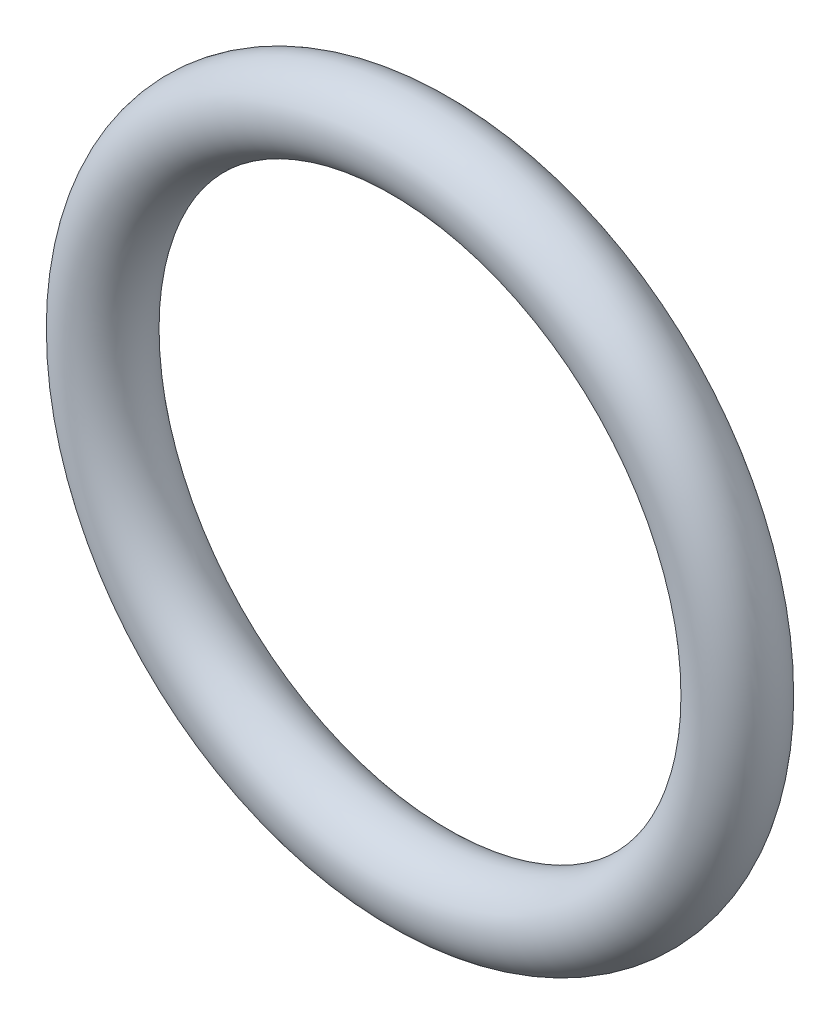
ISO-10303-21;
HEADER;
FILE_DESCRIPTION(('STEP AP214'),'2;1');
FILE_NAME('part.step','',(''),(''),'','','');
FILE_SCHEMA(('AUTOMOTIVE_DESIGN { 1 0 10303 214 1 1 1 1 }'));
ENDSEC;
DATA;
#1=APPLICATION_CONTEXT('core data for automotive mechanical design processes');
#2=APPLICATION_PROTOCOL_DEFINITION('international standard','automotive_design',2000,#1);
#3=PRODUCT_CONTEXT('',#1,'mechanical');
#4=PRODUCT('Part','Part','',(#3));
#5=PRODUCT_RELATED_PRODUCT_CATEGORY('part','',(#4));
#6=PRODUCT_DEFINITION_FORMATION('','',#4);
#7=PRODUCT_DEFINITION_CONTEXT('part definition',#1,'design');
#8=PRODUCT_DEFINITION('design','',#6,#7);
#9=PRODUCT_DEFINITION_SHAPE('','',#8);
#10=(LENGTH_UNIT() NAMED_UNIT(*) SI_UNIT(.MILLI.,.METRE.));
#11=(NAMED_UNIT(*) PLANE_ANGLE_UNIT() SI_UNIT($,.RADIAN.));
#12=(NAMED_UNIT(*) SI_UNIT($,.STERADIAN.) SOLID_ANGLE_UNIT());
#13=UNCERTAINTY_MEASURE_WITH_UNIT(LENGTH_MEASURE(1.E-05),#10,'distance_accuracy_value','');
#14=(GEOMETRIC_REPRESENTATION_CONTEXT(3) GLOBAL_UNCERTAINTY_ASSIGNED_CONTEXT((#13)) GLOBAL_UNIT_ASSIGNED_CONTEXT((#10,
#11,#12)) REPRESENTATION_CONTEXT('',''));
#15=CARTESIAN_POINT('',(0.,0.,0.));
#16=DIRECTION('',(0.,0.,1.));
#17=DIRECTION('',(1.,0.,0.));
#18=AXIS2_PLACEMENT_3D('',#15,#16,#17);
#19=CARTESIAN_POINT('',(0.,0.,0.));
#20=DIRECTION('',(0.,0.,1.));
#21=DIRECTION('',(1.,0.,0.));
#22=AXIS2_PLACEMENT_3D('',#19,#20,#21);
#23=TOROIDAL_SURFACE('',#22,4.575,0.575);
#24=CARTESIAN_POINT('',(5.15,0.,0.));
#25=VERTEX_POINT('',#24);
#26=VERTEX_LOOP('',#25);
#27=FACE_BOUND('',#26,.T.);
#28=ADVANCED_FACE('F27',(#27),#23,.T.);
#29=CLOSED_SHELL('',(#28));
#30=MANIFOLD_SOLID_BREP('B2',#29);
#31=ADVANCED_BREP_SHAPE_REPRESENTATION('',(#18,#30),#14);
#32=SHAPE_DEFINITION_REPRESENTATION(#9,#31);
ENDSEC;
END-ISO-10303-21;
